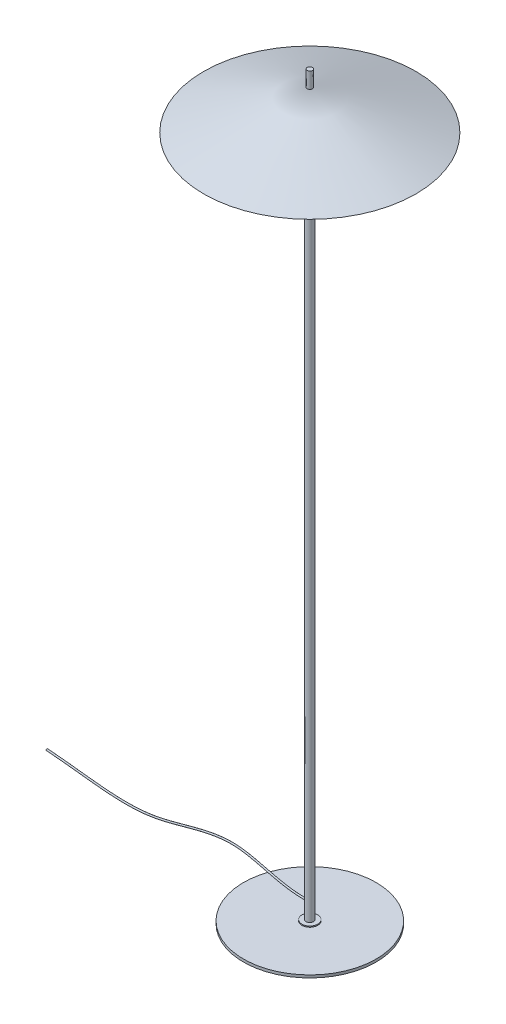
ISO-10303-21;
HEADER;
FILE_DESCRIPTION(('STEP AP214'),'2;1');
FILE_NAME('part.step','',(''),(''),'','','');
FILE_SCHEMA(('AUTOMOTIVE_DESIGN { 1 0 10303 214 1 1 1 1 }'));
ENDSEC;
DATA;
#1=APPLICATION_CONTEXT('core data for automotive mechanical design processes');
#2=APPLICATION_PROTOCOL_DEFINITION('international standard','automotive_design',2000,#1);
#3=PRODUCT_CONTEXT('',#1,'mechanical');
#4=PRODUCT('Part','Part','',(#3));
#5=PRODUCT_RELATED_PRODUCT_CATEGORY('part','',(#4));
#6=PRODUCT_DEFINITION_FORMATION('','',#4);
#7=PRODUCT_DEFINITION_CONTEXT('part definition',#1,'design');
#8=PRODUCT_DEFINITION('design','',#6,#7);
#9=PRODUCT_DEFINITION_SHAPE('','',#8);
#10=(LENGTH_UNIT() NAMED_UNIT(*) SI_UNIT(.MILLI.,.METRE.));
#11=(NAMED_UNIT(*) PLANE_ANGLE_UNIT() SI_UNIT($,.RADIAN.));
#12=(NAMED_UNIT(*) SI_UNIT($,.STERADIAN.) SOLID_ANGLE_UNIT());
#13=UNCERTAINTY_MEASURE_WITH_UNIT(LENGTH_MEASURE(1.E-05),#10,'distance_accuracy_value','');
#14=(GEOMETRIC_REPRESENTATION_CONTEXT(3) GLOBAL_UNCERTAINTY_ASSIGNED_CONTEXT((#13)) GLOBAL_UNIT_ASSIGNED_CONTEXT((#10,
#11,#12)) REPRESENTATION_CONTEXT('',''));
#15=CARTESIAN_POINT('',(0.,0.,0.));
#16=DIRECTION('',(0.,0.,1.));
#17=DIRECTION('',(1.,0.,0.));
#18=AXIS2_PLACEMENT_3D('',#15,#16,#17);
#19=CARTESIAN_POINT('',(0.,-1284.02242406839,0.));
#20=DIRECTION('',(0.,1.,0.));
#21=DIRECTION('',(0.,0.,1.));
#22=AXIS2_PLACEMENT_3D('',#19,#20,#21);
#23=PLANE('',#22);
#24=CARTESIAN_POINT('',(0.,-1284.02242406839,0.));
#25=DIRECTION('',(0.,1.,0.));
#26=DIRECTION('',(0.,0.,1.));
#27=AXIS2_PLACEMENT_3D('',#24,#25,#26);
#28=CIRCLE('',#27,15.);
#29=CARTESIAN_POINT('',(0.,-1284.02242406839,15.));
#30=VERTEX_POINT('',#29);
#31=EDGE_CURVE('E12',#30,#30,#28,.T.);
#32=ORIENTED_EDGE('',*,*,#31,.T.);
#33=EDGE_LOOP('',(#32));
#34=FACE_BOUND('',#33,.T.);
#35=CARTESIAN_POINT('',(0.,-1284.02242406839,0.));
#36=DIRECTION('',(0.,1.,0.));
#37=DIRECTION('',(0.,0.,1.));
#38=AXIS2_PLACEMENT_3D('',#35,#36,#37);
#39=CIRCLE('',#38,7.);
#40=CARTESIAN_POINT('',(0.,-1284.02242406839,7.));
#41=VERTEX_POINT('',#40);
#42=EDGE_CURVE('E76',#41,#41,#39,.T.);
#43=ORIENTED_EDGE('',*,*,#42,.F.);
#44=EDGE_LOOP('',(#43));
#45=FACE_BOUND('',#44,.T.);
#46=ADVANCED_FACE('F65',(#34,#45),#23,.T.);
#47=CARTESIAN_POINT('',(0.,-1286.02242406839,0.));
#48=DIRECTION('',(0.,1.,0.));
#49=DIRECTION('',(0.,0.,1.));
#50=AXIS2_PLACEMENT_3D('',#47,#48,#49);
#51=PLANE('',#50);
#52=CARTESIAN_POINT('',(0.,-1286.02242406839,0.));
#53=DIRECTION('',(0.,1.,0.));
#54=DIRECTION('',(0.,0.,1.));
#55=AXIS2_PLACEMENT_3D('',#52,#53,#54);
#56=CIRCLE('',#55,15.);
#57=CARTESIAN_POINT('',(0.,-1286.02242406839,15.));
#58=VERTEX_POINT('',#57);
#59=EDGE_CURVE('E69',#58,#58,#56,.T.);
#60=ORIENTED_EDGE('',*,*,#59,.F.);
#61=EDGE_LOOP('',(#60));
#62=FACE_BOUND('',#61,.T.);
#63=CARTESIAN_POINT('',(0.,-1286.02242406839,0.));
#64=DIRECTION('',(0.,1.,0.));
#65=DIRECTION('',(0.,0.,1.));
#66=AXIS2_PLACEMENT_3D('',#63,#64,#65);
#67=CIRCLE('',#66,7.);
#68=CARTESIAN_POINT('',(0.,-1286.02242406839,7.));
#69=VERTEX_POINT('',#68);
#70=EDGE_CURVE('E78',#69,#69,#67,.T.);
#71=ORIENTED_EDGE('',*,*,#70,.T.);
#72=EDGE_LOOP('',(#71));
#73=FACE_BOUND('',#72,.T.);
#74=ADVANCED_FACE('F88',(#62,#73),#51,.F.);
#75=CARTESIAN_POINT('',(0.,-1284.02242406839,0.));
#76=DIRECTION('',(0.,-1.,0.));
#77=DIRECTION('',(0.,0.,-1.));
#78=AXIS2_PLACEMENT_3D('',#75,#76,#77);
#79=CYLINDRICAL_SURFACE('',#78,15.);
#80=ORIENTED_EDGE('',*,*,#31,.F.);
#81=EDGE_LOOP('',(#80));
#82=FACE_BOUND('',#81,.T.);
#83=ORIENTED_EDGE('',*,*,#59,.T.);
#84=EDGE_LOOP('',(#83));
#85=FACE_BOUND('',#84,.T.);
#86=ADVANCED_FACE('F67',(#82,#85),#79,.T.);
#87=CARTESIAN_POINT('',(0.,-1284.02242406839,0.));
#88=DIRECTION('',(0.,-1.,0.));
#89=DIRECTION('',(0.,0.,-1.));
#90=AXIS2_PLACEMENT_3D('',#87,#88,#89);
#91=CYLINDRICAL_SURFACE('',#90,7.);
#92=ORIENTED_EDGE('',*,*,#42,.T.);
#93=EDGE_LOOP('',(#92));
#94=FACE_BOUND('',#93,.T.);
#95=ORIENTED_EDGE('',*,*,#70,.F.);
#96=EDGE_LOOP('',(#95));
#97=FACE_BOUND('',#96,.T.);
#98=ADVANCED_FACE('F84',(#94,#97),#91,.F.);
#99=CLOSED_SHELL('',(#46,#74,#86,#98));
#100=MANIFOLD_SOLID_BREP('B2',#99);
#101=CARTESIAN_POINT('',(0.,-1291.02242406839,0.));
#102=DIRECTION('',(0.,1.,0.));
#103=DIRECTION('',(0.,0.,1.));
#104=AXIS2_PLACEMENT_3D('',#101,#102,#103);
#105=CYLINDRICAL_SURFACE('',#104,125.);
#106=CARTESIAN_POINT('',(0.,-1291.02242406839,0.));
#107=DIRECTION('',(0.,-1.,0.));
#108=DIRECTION('',(0.,0.,-1.));
#109=AXIS2_PLACEMENT_3D('',#106,#107,#108);
#110=CIRCLE('',#109,125.);
#111=CARTESIAN_POINT('',(0.,-1291.02242406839,-125.));
#112=VERTEX_POINT('',#111);
#113=EDGE_CURVE('E64',#112,#112,#110,.T.);
#114=ORIENTED_EDGE('',*,*,#113,.F.);
#115=EDGE_LOOP('',(#114));
#116=FACE_BOUND('',#115,.T.);
#117=CARTESIAN_POINT('',(0.,-1286.02242406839,0.));
#118=DIRECTION('',(0.,-1.,0.));
#119=DIRECTION('',(0.,0.,-1.));
#120=AXIS2_PLACEMENT_3D('',#117,#118,#119);
#121=CIRCLE('',#120,125.);
#122=CARTESIAN_POINT('',(0.,-1286.02242406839,-125.));
#123=VERTEX_POINT('',#122);
#124=EDGE_CURVE('E139',#123,#123,#121,.T.);
#125=ORIENTED_EDGE('',*,*,#124,.T.);
#126=EDGE_LOOP('',(#125));
#127=FACE_BOUND('',#126,.T.);
#128=ADVANCED_FACE('F136',(#116,#127),#105,.T.);
#129=CARTESIAN_POINT('',(0.,-1291.02242406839,0.));
#130=DIRECTION('',(0.,-1.,0.));
#131=DIRECTION('',(0.,0.,-1.));
#132=AXIS2_PLACEMENT_3D('',#129,#130,#131);
#133=PLANE('',#132);
#134=ORIENTED_EDGE('',*,*,#113,.T.);
#135=EDGE_LOOP('',(#134));
#136=FACE_BOUND('',#135,.T.);
#137=ADVANCED_FACE('F151',(#136),#133,.T.);
#138=CARTESIAN_POINT('',(0.,-1286.02242406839,0.));
#139=DIRECTION('',(0.,-1.,0.));
#140=DIRECTION('',(0.,0.,-1.));
#141=AXIS2_PLACEMENT_3D('',#138,#139,#140);
#142=PLANE('',#141);
#143=ORIENTED_EDGE('',*,*,#124,.F.);
#144=EDGE_LOOP('',(#143));
#145=FACE_BOUND('',#144,.T.);
#146=ADVANCED_FACE('F149',(#145),#142,.F.);
#147=CLOSED_SHELL('',(#128,#137,#146));
#148=MANIFOLD_SOLID_BREP('B7',#147);
#149=CARTESIAN_POINT('',(0.,-66.0224240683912,0.));
#150=DIRECTION('',(0.,-1.,0.));
#151=DIRECTION('',(0.,0.,-1.));
#152=AXIS2_PLACEMENT_3D('',#149,#150,#151);
#153=PLANE('',#152);
#154=CARTESIAN_POINT('',(0.,-66.0224240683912,0.));
#155=DIRECTION('',(0.,-1.,0.));
#156=DIRECTION('',(0.,0.,-1.));
#157=AXIS2_PLACEMENT_3D('',#154,#155,#156);
#158=CIRCLE('',#157,7.);
#159=CARTESIAN_POINT('',(0.,-66.0224240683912,-7.));
#160=VERTEX_POINT('',#159);
#161=EDGE_CURVE('E201',#160,#160,#158,.T.);
#162=ORIENTED_EDGE('',*,*,#161,.F.);
#163=EDGE_LOOP('',(#162));
#164=FACE_BOUND('',#163,.T.);
#165=ADVANCED_FACE('F184',(#164),#153,.F.);
#166=CARTESIAN_POINT('',(0.,-1286.02242406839,0.));
#167=DIRECTION('',(0.,-1.,0.));
#168=DIRECTION('',(0.,0.,-1.));
#169=AXIS2_PLACEMENT_3D('',#166,#167,#168);
#170=PLANE('',#169);
#171=CARTESIAN_POINT('',(0.,-1286.02242406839,0.));
#172=DIRECTION('',(0.,-1.,0.));
#173=DIRECTION('',(0.,0.,-1.));
#174=AXIS2_PLACEMENT_3D('',#171,#172,#173);
#175=CIRCLE('',#174,7.);
#176=CARTESIAN_POINT('',(0.,-1286.02242406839,-7.));
#177=VERTEX_POINT('',#176);
#178=EDGE_CURVE('E196',#177,#177,#175,.T.);
#179=ORIENTED_EDGE('',*,*,#178,.T.);
#180=EDGE_LOOP('',(#179));
#181=FACE_BOUND('',#180,.T.);
#182=ADVANCED_FACE('F218',(#181),#170,.T.);
#183=CARTESIAN_POINT('',(0.,-66.0224240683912,0.));
#184=DIRECTION('',(0.,-1.,0.));
#185=DIRECTION('',(0.,0.,-1.));
#186=AXIS2_PLACEMENT_3D('',#183,#184,#185);
#187=CYLINDRICAL_SURFACE('',#186,7.);
#188=CARTESIAN_POINT('',(-7.00000000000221,-1256.18144920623,0.));
#189=CARTESIAN_POINT('',(-6.99999856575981,-1256.18144670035,0.0829595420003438));
#190=CARTESIAN_POINT('',(-6.99851019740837,-1256.17450686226,0.165952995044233));
#191=CARTESIAN_POINT('',(-6.99271734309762,-1256.14696791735,0.329578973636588));
#192=CARTESIAN_POINT('',(-6.98841078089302,-1256.12635873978,0.410209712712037));
#193=CARTESIAN_POINT('',(-6.97746266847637,-1256.07218014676,0.566713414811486));
#194=CARTESIAN_POINT('',(-6.970823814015,-1256.03862568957,0.642591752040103));
#195=CARTESIAN_POINT('',(-6.95592671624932,-1255.95957729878,0.787659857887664));
#196=CARTESIAN_POINT('',(-6.94766850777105,-1255.91408362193,0.856849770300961));
#197=CARTESIAN_POINT('',(-6.93026581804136,-1255.811588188,0.987856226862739));
#198=CARTESIAN_POINT('',(-6.92110895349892,-1255.75440880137,1.04953214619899));
#199=CARTESIAN_POINT('',(-6.90302540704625,-1255.63057586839,1.16255039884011));
#200=CARTESIAN_POINT('',(-6.89409875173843,-1255.56392123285,1.21389154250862));
#201=CARTESIAN_POINT('',(-6.87733598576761,-1255.42181482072,1.3055500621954));
#202=CARTESIAN_POINT('',(-6.86951866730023,-1255.34624396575,1.34568659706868));
#203=CARTESIAN_POINT('',(-6.85605895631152,-1255.18924226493,1.41266778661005));
#204=CARTESIAN_POINT('',(-6.85041634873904,-1255.10781199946,1.43951375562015));
#205=CARTESIAN_POINT('',(-6.84204988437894,-1254.94255385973,1.47876800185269));
#206=CARTESIAN_POINT('',(-6.83928778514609,-1254.85877297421,1.49136563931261));
#207=CARTESIAN_POINT('',(-6.83689164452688,-1254.69024527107,1.50231374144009));
#208=CARTESIAN_POINT('',(-6.83725715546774,-1254.60549859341,1.50066624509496));
#209=CARTESIAN_POINT('',(-6.84103793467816,-1254.43932963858,1.48333168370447));
#210=CARTESIAN_POINT('',(-6.844389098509,-1254.35787491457,1.46793970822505));
#211=CARTESIAN_POINT('',(-6.85366805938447,-1254.19875713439,1.42398527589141));
#212=CARTESIAN_POINT('',(-6.8595959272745,-1254.12109418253,1.3954224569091));
#213=CARTESIAN_POINT('',(-6.87337645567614,-1253.9714767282,1.32587677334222));
#214=CARTESIAN_POINT('',(-6.88123434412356,-1253.89953844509,1.28486010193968));
#215=CARTESIAN_POINT('',(-6.89799608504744,-1253.76349189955,1.19159074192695));
#216=CARTESIAN_POINT('',(-6.90690006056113,-1253.69938455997,1.13933673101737));
#217=CARTESIAN_POINT('',(-6.92496292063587,-1253.57951184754,1.02389404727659));
#218=CARTESIAN_POINT('',(-6.93412341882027,-1253.52393005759,0.960514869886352));
#219=CARTESIAN_POINT('',(-6.95151743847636,-1253.42411678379,0.825256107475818));
#220=CARTESIAN_POINT('',(-6.95975093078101,-1253.37988565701,0.75337625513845));
#221=CARTESIAN_POINT('',(-6.9744179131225,-1253.30383071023,0.60269848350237));
#222=CARTESIAN_POINT('',(-6.98084229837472,-1253.2720693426,0.523868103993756));
#223=CARTESIAN_POINT('',(-6.99111277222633,-1253.22223020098,0.36183585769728));
#224=CARTESIAN_POINT('',(-6.99495914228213,-1253.2041509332,0.278634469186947));
#225=CARTESIAN_POINT('',(-6.99960296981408,-1253.1824065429,0.111535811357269));
#226=CARTESIAN_POINT('',(-7.00044455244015,-1253.17853278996,0.027666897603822));
#227=CARTESIAN_POINT('',(-6.99910857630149,-1253.18474183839,-0.139524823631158));
#228=CARTESIAN_POINT('',(-6.99693117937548,-1253.19482389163,-0.222847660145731));
#229=CARTESIAN_POINT('',(-6.98983118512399,-1253.22847505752,-0.385822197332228));
#230=CARTESIAN_POINT('',(-6.98493308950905,-1253.25192384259,-0.465499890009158));
#231=CARTESIAN_POINT('',(-6.97293830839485,-1253.311521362,-0.61977705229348));
#232=CARTESIAN_POINT('',(-6.96584145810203,-1253.34767104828,-0.694376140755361));
#233=CARTESIAN_POINT('',(-6.95011732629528,-1253.43213877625,-0.837319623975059));
#234=CARTESIAN_POINT('',(-6.94147346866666,-1253.48059126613,-0.905582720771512));
#235=CARTESIAN_POINT('',(-6.92365040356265,-1253.58813926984,-1.03306113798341));
#236=CARTESIAN_POINT('',(-6.91447114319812,-1253.64723583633,-1.09227556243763));
#237=CARTESIAN_POINT('',(-6.89646325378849,-1253.7753639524,-1.2007773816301));
#238=CARTESIAN_POINT('',(-6.88764090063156,-1253.84451702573,-1.24992248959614));
#239=CARTESIAN_POINT('',(-6.87149060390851,-1253.99027213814,-1.33586563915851));
#240=CARTESIAN_POINT('',(-6.86416256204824,-1254.06687368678,-1.37266449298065));
#241=CARTESIAN_POINT('',(-6.85191344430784,-1254.22473122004,-1.43255545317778));
#242=CARTESIAN_POINT('',(-6.8469733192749,-1254.30594439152,-1.45575636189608));
#243=CARTESIAN_POINT('',(-6.83999853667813,-1254.47123012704,-1.48818681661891));
#244=CARTESIAN_POINT('',(-6.8379634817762,-1254.55530229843,-1.49741827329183));
#245=CARTESIAN_POINT('',(-6.83704600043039,-1254.7222419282,-1.50160085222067));
#246=CARTESIAN_POINT('',(-6.83810541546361,-1254.8051025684,-1.49681540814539));
#247=CARTESIAN_POINT('',(-6.84311716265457,-1254.96881541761,-1.47373147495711));
#248=CARTESIAN_POINT('',(-6.84706954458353,-1255.04966759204,-1.45543275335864));
#249=CARTESIAN_POINT('',(-6.85742069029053,-1255.20730909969,-1.40585146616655));
#250=CARTESIAN_POINT('',(-6.86382365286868,-1255.2840912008,-1.37454660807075));
#251=CARTESIAN_POINT('',(-6.87470836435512,-1255.39447526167,-1.31861309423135));
#252=CARTESIAN_POINT('',(-6.87855105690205,-1255.43047984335,-1.29846663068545));
#253=CARTESIAN_POINT('',(-6.8865609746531,-1255.50072933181,-1.25529349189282));
#254=CARTESIAN_POINT('',(-6.89072850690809,-1255.53497252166,-1.23226407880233));
#255=CARTESIAN_POINT('',(-6.903731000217,-1255.63610630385,-1.15803969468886));
#256=CARTESIAN_POINT('',(-6.91290450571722,-1255.69983585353,-1.10250052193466));
#257=CARTESIAN_POINT('',(-6.93111194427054,-1255.81712221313,-0.981536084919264));
#258=CARTESIAN_POINT('',(-6.94014587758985,-1255.87067904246,-0.916110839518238));
#259=CARTESIAN_POINT('',(-6.95288868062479,-1255.94250899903,-0.811539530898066));
#260=CARTESIAN_POINT('',(-6.9570235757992,-1255.96514272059,-0.775377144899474));
#261=CARTESIAN_POINT('',(-6.96488503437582,-1256.00724823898,-0.701261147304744));
#262=CARTESIAN_POINT('',(-6.96861196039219,-1256.02672285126,-0.663309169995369));
#263=CARTESIAN_POINT('',(-6.97901498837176,-1256.08017344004,-0.547134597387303));
#264=CARTESIAN_POINT('',(-6.98492560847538,-1256.10924275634,-0.466496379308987));
#265=CARTESIAN_POINT('',(-6.99289703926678,-1256.14785715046,-0.321452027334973));
#266=CARTESIAN_POINT('',(-6.99554397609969,-1256.1604281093,-0.257854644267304));
#267=CARTESIAN_POINT('',(-6.99909597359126,-1256.17722491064,-0.12951169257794));
#268=CARTESIAN_POINT('',(-7.00000111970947,-1256.18145116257,-0.0647661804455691));
#269=CARTESIAN_POINT('',(-7.00000000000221,-1256.18144920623,0.));
#270=B_SPLINE_CURVE_WITH_KNOTS('',3,(#188,#189,#190,#191,#192,#193,#194,#195,#196,#197,#198,
#199,#200,#201,#202,#203,#204,#205,#206,#207,#208,#209,#210,#211,#212,#213,#214,#215,#216,#217,
#218,#219,#220,#221,#222,#223,#224,#225,#226,#227,#228,#229,#230,#231,#232,#233,#234,#235,#236,
#237,#238,#239,#240,#241,#242,#243,#244,#245,#246,#247,#248,#249,#250,#251,#252,#253,#254,#255,
#256,#257,#258,#259,#260,#261,#262,#263,#264,#265,#266,#267,#268,#269),.UNSPECIFIED.,.T.,.F.,(4,
2,2,2,2,2,2,2,2,2,2,2,2,2,2,2,2,2,2,2,2,2,2,2,2,2,2,2,2,2,2,2,2,2,2,2,2,2,2,2,4),(0.,
0.248638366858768,0.497460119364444,0.745995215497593,0.994524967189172,1.24715873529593,
1.49982156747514,1.75635333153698,2.01285972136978,2.26591554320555,2.51893514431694,
2.76664972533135,3.01437111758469,3.26277107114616,3.51120026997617,3.76439435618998,
4.01759640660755,4.2720508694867,4.52647754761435,4.77715225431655,5.02781352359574,
5.27625318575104,5.52471147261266,5.77601153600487,6.02733646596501,6.28199927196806,
6.53664532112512,6.78922500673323,7.04177014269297,7.2895995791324,7.53743327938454,
7.78569353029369,7.90988336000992,8.03419203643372,8.288029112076,8.54186570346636,
8.67031047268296,8.7986401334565,9.05494916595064,9.2490696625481,9.44318063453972),.UNSPECIFIED.);
#271=CARTESIAN_POINT('',(-7.00000000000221,-1256.18144920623,0.));
#272=VERTEX_POINT('',#271);
#273=EDGE_CURVE('E134',#272,#272,#270,.T.);
#274=ORIENTED_EDGE('',*,*,#273,.F.);
#275=EDGE_LOOP('',(#274));
#276=FACE_BOUND('',#275,.T.);
#277=ORIENTED_EDGE('',*,*,#178,.F.);
#278=EDGE_LOOP('',(#277));
#279=FACE_BOUND('',#278,.T.);
#280=ORIENTED_EDGE('',*,*,#161,.T.);
#281=EDGE_LOOP('',(#280));
#282=FACE_BOUND('',#281,.T.);
#283=ADVANCED_FACE('F216',(#276,#279,#282),#187,.T.);
#284=CARTESIAN_POINT('',(-495.481401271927,-1254.51800329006,0.));
#285=DIRECTION('',(-0.997630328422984,0.068802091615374,0.));
#286=DIRECTION('',(-0.0688020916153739,-0.997630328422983,0.));
#287=AXIS2_PLACEMENT_3D('',#284,#285,#286);
#288=PLANE('',#287);
#289=CARTESIAN_POINT('',(-495.481401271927,-1254.51800329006,0.));
#290=DIRECTION('',(-0.997630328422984,0.068802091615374,0.));
#291=DIRECTION('',(-0.0688020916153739,-0.997630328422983,0.));
#292=AXIS2_PLACEMENT_3D('',#289,#290,#291);
#293=CIRCLE('',#292,1.5);
#294=CARTESIAN_POINT('',(-495.584604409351,-1256.01444878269,0.));
#295=VERTEX_POINT('',#294);
#296=EDGE_CURVE('E210',#295,#295,#293,.T.);
#297=ORIENTED_EDGE('',*,*,#296,.T.);
#298=EDGE_LOOP('',(#297));
#299=FACE_BOUND('',#298,.T.);
#300=ADVANCED_FACE('F211',(#299),#288,.T.);
#301=CARTESIAN_POINT('',(-2.4572294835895,-1256.0161587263,0.));
#302=CARTESIAN_POINT('',(-28.9617866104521,-1257.33180030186,0.));
#303=CARTESIAN_POINT('',(-52.7011738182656,-1252.32474152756,0.));
#304=CARTESIAN_POINT('',(-97.9228687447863,-1241.29523358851,0.));
#305=CARTESIAN_POINT('',(-119.410825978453,-1235.2839906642,0.));
#306=CARTESIAN_POINT('',(-165.964214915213,-1233.4587515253,0.));
#307=CARTESIAN_POINT('',(-191.456806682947,-1238.82727670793,0.));
#308=CARTESIAN_POINT('',(-242.904252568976,-1252.23030735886,0.));
#309=CARTESIAN_POINT('',(-268.84989802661,-1260.25828715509,0.));
#310=CARTESIAN_POINT('',(-327.116092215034,-1269.97850498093,0.));
#311=CARTESIAN_POINT('',(-358.902748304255,-1269.1228235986,0.));
#312=CARTESIAN_POINT('',(-424.583466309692,-1263.41902210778,0.));
#313=CARTESIAN_POINT('',(-458.484848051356,-1258.57305265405,0.));
#314=CARTESIAN_POINT('',(-495.584604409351,-1256.01444878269,0.));
#315=CARTESIAN_POINT('',(-2.4572294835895,-1256.0161587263,3.));
#316=CARTESIAN_POINT('',(-28.9617866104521,-1257.33180030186,3.));
#317=CARTESIAN_POINT('',(-52.7011738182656,-1252.32474152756,3.));
#318=CARTESIAN_POINT('',(-97.9228687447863,-1241.29523358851,3.));
#319=CARTESIAN_POINT('',(-119.410825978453,-1235.2839906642,3.));
#320=CARTESIAN_POINT('',(-165.964214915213,-1233.4587515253,3.));
#321=CARTESIAN_POINT('',(-191.456806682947,-1238.82727670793,3.));
#322=CARTESIAN_POINT('',(-242.904252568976,-1252.23030735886,3.));
#323=CARTESIAN_POINT('',(-268.84989802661,-1260.25828715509,3.));
#324=CARTESIAN_POINT('',(-327.116092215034,-1269.97850498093,3.));
#325=CARTESIAN_POINT('',(-358.902748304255,-1269.1228235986,3.));
#326=CARTESIAN_POINT('',(-424.583466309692,-1263.41902210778,3.));
#327=CARTESIAN_POINT('',(-458.484848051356,-1258.57305265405,3.));
#328=CARTESIAN_POINT('',(-495.584604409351,-1256.01444878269,3.));
#329=CARTESIAN_POINT('',(-2.60596130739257,-1253.01984785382,3.));
#330=CARTESIAN_POINT('',(-28.6453825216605,-1254.31240087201,3.));
#331=CARTESIAN_POINT('',(-52.0542601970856,-1249.39458199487,3.));
#332=CARTESIAN_POINT('',(-97.1480664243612,-1238.39626593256,3.));
#333=CARTESIAN_POINT('',(-118.827345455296,-1232.30456249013,3.));
#334=CARTESIAN_POINT('',(-166.364118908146,-1230.44076736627,3.));
#335=CARTESIAN_POINT('',(-192.124373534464,-1235.90105648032,3.));
#336=CARTESIAN_POINT('',(-243.749310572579,-1249.35032693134,3.));
#337=CARTESIAN_POINT('',(-269.623201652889,-1257.34583395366,3.));
#338=CARTESIAN_POINT('',(-327.249415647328,-1266.95928751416,3.));
#339=CARTESIAN_POINT('',(-358.757990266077,-1266.12410370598,3.));
#340=CARTESIAN_POINT('',(-424.209129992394,-1260.44023908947,3.));
#341=CARTESIAN_POINT('',(-458.144375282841,-1255.58940763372,3.));
#342=CARTESIAN_POINT('',(-495.378198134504,-1253.02155779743,3.));
#343=CARTESIAN_POINT('',(-2.60596130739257,-1253.01984785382,0.));
#344=CARTESIAN_POINT('',(-28.6453825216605,-1254.31240087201,0.));
#345=CARTESIAN_POINT('',(-52.0542601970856,-1249.39458199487,0.));
#346=CARTESIAN_POINT('',(-97.1480664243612,-1238.39626593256,0.));
#347=CARTESIAN_POINT('',(-118.827345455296,-1232.30456249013,0.));
#348=CARTESIAN_POINT('',(-166.364118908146,-1230.44076736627,0.));
#349=CARTESIAN_POINT('',(-192.124373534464,-1235.90105648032,0.));
#350=CARTESIAN_POINT('',(-243.749310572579,-1249.35032693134,0.));
#351=CARTESIAN_POINT('',(-269.623201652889,-1257.34583395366,0.));
#352=CARTESIAN_POINT('',(-327.249415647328,-1266.95928751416,0.));
#353=CARTESIAN_POINT('',(-358.757990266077,-1266.12410370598,0.));
#354=CARTESIAN_POINT('',(-424.209129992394,-1260.44023908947,0.));
#355=CARTESIAN_POINT('',(-458.14437528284,-1255.58940763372,0.));
#356=CARTESIAN_POINT('',(-495.378198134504,-1253.02155779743,0.));
#357=CARTESIAN_POINT('',(-2.60596130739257,-1253.01984785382,-3.));
#358=CARTESIAN_POINT('',(-28.6453825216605,-1254.31240087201,-3.));
#359=CARTESIAN_POINT('',(-52.0542601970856,-1249.39458199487,-3.));
#360=CARTESIAN_POINT('',(-97.1480664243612,-1238.39626593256,-3.));
#361=CARTESIAN_POINT('',(-118.827345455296,-1232.30456249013,-3.));
#362=CARTESIAN_POINT('',(-166.364118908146,-1230.44076736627,-3.));
#363=CARTESIAN_POINT('',(-192.124373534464,-1235.90105648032,-3.));
#364=CARTESIAN_POINT('',(-243.749310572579,-1249.35032693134,-3.));
#365=CARTESIAN_POINT('',(-269.623201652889,-1257.34583395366,-3.));
#366=CARTESIAN_POINT('',(-327.249415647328,-1266.95928751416,-3.));
#367=CARTESIAN_POINT('',(-358.757990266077,-1266.12410370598,-3.));
#368=CARTESIAN_POINT('',(-424.209129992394,-1260.44023908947,-3.));
#369=CARTESIAN_POINT('',(-458.144375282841,-1255.58940763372,-3.));
#370=CARTESIAN_POINT('',(-495.378198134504,-1253.02155779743,-3.));
#371=CARTESIAN_POINT('',(-2.4572294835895,-1256.0161587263,-3.));
#372=CARTESIAN_POINT('',(-28.9617866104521,-1257.33180030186,-3.));
#373=CARTESIAN_POINT('',(-52.7011738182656,-1252.32474152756,-3.));
#374=CARTESIAN_POINT('',(-97.9228687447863,-1241.29523358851,-3.));
#375=CARTESIAN_POINT('',(-119.410825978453,-1235.2839906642,-3.));
#376=CARTESIAN_POINT('',(-165.964214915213,-1233.4587515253,-3.));
#377=CARTESIAN_POINT('',(-191.456806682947,-1238.82727670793,-3.));
#378=CARTESIAN_POINT('',(-242.904252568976,-1252.23030735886,-3.));
#379=CARTESIAN_POINT('',(-268.84989802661,-1260.25828715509,-3.));
#380=CARTESIAN_POINT('',(-327.116092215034,-1269.97850498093,-3.));
#381=CARTESIAN_POINT('',(-358.902748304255,-1269.1228235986,-3.));
#382=CARTESIAN_POINT('',(-424.583466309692,-1263.41902210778,-3.));
#383=CARTESIAN_POINT('',(-458.484848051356,-1258.57305265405,-3.));
#384=CARTESIAN_POINT('',(-495.584604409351,-1256.01444878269,-3.));
#385=CARTESIAN_POINT('',(-2.4572294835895,-1256.0161587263,0.));
#386=CARTESIAN_POINT('',(-28.9617866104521,-1257.33180030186,0.));
#387=CARTESIAN_POINT('',(-52.7011738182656,-1252.32474152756,0.));
#388=CARTESIAN_POINT('',(-97.9228687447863,-1241.29523358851,0.));
#389=CARTESIAN_POINT('',(-119.410825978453,-1235.2839906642,0.));
#390=CARTESIAN_POINT('',(-165.964214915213,-1233.4587515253,0.));
#391=CARTESIAN_POINT('',(-191.456806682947,-1238.82727670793,0.));
#392=CARTESIAN_POINT('',(-242.904252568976,-1252.23030735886,0.));
#393=CARTESIAN_POINT('',(-268.84989802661,-1260.25828715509,0.));
#394=CARTESIAN_POINT('',(-327.116092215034,-1269.97850498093,0.));
#395=CARTESIAN_POINT('',(-358.902748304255,-1269.1228235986,0.));
#396=CARTESIAN_POINT('',(-424.583466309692,-1263.41902210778,0.));
#397=CARTESIAN_POINT('',(-458.484848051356,-1258.57305265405,0.));
#398=CARTESIAN_POINT('',(-495.584604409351,-1256.01444878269,0.));
#399=(BOUNDED_SURFACE() B_SPLINE_SURFACE(3,3,((#301,#302,#303,#304,#305,#306,#307,#308,#309,
#310,#311,#312,#313,#314),(#315,#316,#317,#318,#319,#320,#321,#322,#323,#324,#325,#326,#327,
#328),(#329,#330,#331,#332,#333,#334,#335,#336,#337,#338,#339,#340,#341,#342),(#343,#344,#345,
#346,#347,#348,#349,#350,#351,#352,#353,#354,#355,#356),(#357,#358,#359,#360,#361,#362,#363,
#364,#365,#366,#367,#368,#369,#370),(#371,#372,#373,#374,#375,#376,#377,#378,#379,#380,#381,
#382,#383,#384),(#385,#386,#387,#388,#389,#390,#391,#392,#393,#394,#395,#396,#397,#398)),
.UNSPECIFIED.,.T.,.F.,.F.) B_SPLINE_SURFACE_WITH_KNOTS((4,3,4),(4,2,2,2,2,2,4),(0.,0.5,1.),(0.,
0.141188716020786,0.282377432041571,0.439167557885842,0.595957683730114,0.797978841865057,1.),
.UNSPECIFIED.) GEOMETRIC_REPRESENTATION_ITEM() RATIONAL_B_SPLINE_SURFACE(((1.,1.,1.,1.,1.,1.,1.,
1.,1.,1.,1.,1.,1.,1.),(0.333333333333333,0.333333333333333,0.333333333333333,0.333333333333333,
0.333333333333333,0.333333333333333,0.333333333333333,0.333333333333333,0.333333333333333,
0.333333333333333,0.333333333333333,0.333333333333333,0.333333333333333,0.333333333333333),
(0.333333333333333,0.333333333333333,0.333333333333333,0.333333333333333,0.333333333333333,
0.333333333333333,0.333333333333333,0.333333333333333,0.333333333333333,0.333333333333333,
0.333333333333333,0.333333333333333,0.333333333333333,0.333333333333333),(1.,1.,1.,1.,1.,1.,1.,
1.,1.,1.,1.,1.,1.,1.),(0.333333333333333,0.333333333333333,0.333333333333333,0.333333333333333,
0.333333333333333,0.333333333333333,0.333333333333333,0.333333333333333,0.333333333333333,
0.333333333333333,0.333333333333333,0.333333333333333,0.333333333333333,0.333333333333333),
(0.333333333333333,0.333333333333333,0.333333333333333,0.333333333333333,0.333333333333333,
0.333333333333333,0.333333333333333,0.333333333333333,0.333333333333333,0.333333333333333,
0.333333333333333,0.333333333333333,0.333333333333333,0.333333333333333),(1.,1.,1.,1.,1.,1.,1.,
1.,1.,1.,1.,1.,1.,1.))) REPRESENTATION_ITEM('') SURFACE());
#400=ORIENTED_EDGE('',*,*,#273,.T.);
#401=EDGE_LOOP('',(#400));
#402=FACE_BOUND('',#401,.T.);
#403=ORIENTED_EDGE('',*,*,#296,.F.);
#404=EDGE_LOOP('',(#403));
#405=FACE_BOUND('',#404,.T.);
#406=ADVANCED_FACE('F224',(#402,#405),#399,.T.);
#407=CLOSED_SHELL('',(#165,#182,#283,#300,#406));
#408=MANIFOLD_SOLID_BREP('B59',#407);
#409=CARTESIAN_POINT('',(0.,50.,0.));
#410=DIRECTION('',(0.,-1.,0.));
#411=DIRECTION('',(1.,0.,0.));
#412=AXIS2_PLACEMENT_3D('',#409,#410,#411);
#413=CYLINDRICAL_SURFACE('',#412,20.);
#414=CARTESIAN_POINT('',(0.,50.,0.));
#415=DIRECTION('',(0.,1.,0.));
#416=DIRECTION('',(-1.,0.,0.));
#417=AXIS2_PLACEMENT_3D('',#414,#415,#416);
#418=CIRCLE('',#417,20.);
#419=CARTESIAN_POINT('',(-20.,50.,0.));
#420=VERTEX_POINT('',#419);
#421=EDGE_CURVE('E183',#420,#420,#418,.T.);
#422=ORIENTED_EDGE('',*,*,#421,.F.);
#423=EDGE_LOOP('',(#422));
#424=FACE_BOUND('',#423,.T.);
#425=CARTESIAN_POINT('',(0.,-50.,0.));
#426=DIRECTION('',(0.,1.,0.));
#427=DIRECTION('',(-1.,0.,0.));
#428=AXIS2_PLACEMENT_3D('',#425,#426,#427);
#429=CIRCLE('',#428,20.);
#430=CARTESIAN_POINT('',(-20.,-50.,0.));
#431=VERTEX_POINT('',#430);
#432=EDGE_CURVE('E283',#431,#431,#429,.T.);
#433=ORIENTED_EDGE('',*,*,#432,.T.);
#434=EDGE_LOOP('',(#433));
#435=FACE_BOUND('',#434,.T.);
#436=ADVANCED_FACE('F280',(#424,#435),#413,.T.);
#437=CARTESIAN_POINT('',(0.,50.,0.));
#438=DIRECTION('',(0.,1.,0.));
#439=DIRECTION('',(-1.,0.,0.));
#440=AXIS2_PLACEMENT_3D('',#437,#438,#439);
#441=PLANE('',#440);
#442=ORIENTED_EDGE('',*,*,#421,.T.);
#443=EDGE_LOOP('',(#442));
#444=FACE_BOUND('',#443,.T.);
#445=ADVANCED_FACE('F295',(#444),#441,.T.);
#446=CARTESIAN_POINT('',(0.,-50.,0.));
#447=DIRECTION('',(0.,1.,0.));
#448=DIRECTION('',(-1.,0.,0.));
#449=AXIS2_PLACEMENT_3D('',#446,#447,#448);
#450=PLANE('',#449);
#451=ORIENTED_EDGE('',*,*,#432,.F.);
#452=EDGE_LOOP('',(#451));
#453=FACE_BOUND('',#452,.T.);
#454=ADVANCED_FACE('F293',(#453),#450,.F.);
#455=CLOSED_SHELL('',(#436,#445,#454));
#456=MANIFOLD_SOLID_BREP('B128',#455);
#457=CARTESIAN_POINT('',(0.,74.,0.));
#458=DIRECTION('',(0.,1.,0.));
#459=DIRECTION('',(0.,0.,1.));
#460=AXIS2_PLACEMENT_3D('',#457,#458,#459);
#461=PLANE('',#460);
#462=CARTESIAN_POINT('',(0.,74.,0.));
#463=DIRECTION('',(0.,1.,0.));
#464=DIRECTION('',(0.,0.,1.));
#465=AXIS2_PLACEMENT_3D('',#462,#463,#464);
#466=CIRCLE('',#465,5.);
#467=CARTESIAN_POINT('',(0.,74.,5.));
#468=VERTEX_POINT('',#467);
#469=EDGE_CURVE('E337',#468,#468,#466,.T.);
#470=ORIENTED_EDGE('',*,*,#469,.F.);
#471=EDGE_LOOP('',(#470));
#472=FACE_BOUND('',#471,.T.);
#473=ADVANCED_FACE('F330',(#472),#461,.F.);
#474=CARTESIAN_POINT('',(0.,104.,0.));
#475=DIRECTION('',(0.,1.,0.));
#476=DIRECTION('',(0.,0.,1.));
#477=AXIS2_PLACEMENT_3D('',#474,#475,#476);
#478=PLANE('',#477);
#479=CARTESIAN_POINT('',(0.,104.,0.));
#480=DIRECTION('',(0.,1.,0.));
#481=DIRECTION('',(0.,0.,1.));
#482=AXIS2_PLACEMENT_3D('',#479,#480,#481);
#483=CIRCLE('',#482,5.);
#484=CARTESIAN_POINT('',(0.,104.,5.));
#485=VERTEX_POINT('',#484);
#486=EDGE_CURVE('E278',#485,#485,#483,.T.);
#487=ORIENTED_EDGE('',*,*,#486,.T.);
#488=EDGE_LOOP('',(#487));
#489=FACE_BOUND('',#488,.T.);
#490=ADVANCED_FACE('F344',(#489),#478,.T.);
#491=CARTESIAN_POINT('',(0.,74.,0.));
#492=DIRECTION('',(0.,1.,0.));
#493=DIRECTION('',(0.,0.,1.));
#494=AXIS2_PLACEMENT_3D('',#491,#492,#493);
#495=CYLINDRICAL_SURFACE('',#494,5.);
#496=ORIENTED_EDGE('',*,*,#486,.F.);
#497=EDGE_LOOP('',(#496));
#498=FACE_BOUND('',#497,.T.);
#499=ORIENTED_EDGE('',*,*,#469,.T.);
#500=EDGE_LOOP('',(#499));
#501=FACE_BOUND('',#500,.T.);
#502=ADVANCED_FACE('F346',(#498,#501),#495,.T.);
#503=CLOSED_SHELL('',(#473,#490,#502));
#504=MANIFOLD_SOLID_BREP('B178',#503);
#505=CARTESIAN_POINT('',(0.,-45.461481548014,0.));
#506=DIRECTION('',(0.,1.,0.));
#507=DIRECTION('',(0.,0.,1.));
#508=AXIS2_PLACEMENT_3D('',#505,#506,#507);
#509=PLANE('',#508);
#510=CARTESIAN_POINT('',(0.,-45.461481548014,0.));
#511=DIRECTION('',(0.,1.,0.));
#512=DIRECTION('',(0.,0.,1.));
#513=AXIS2_PLACEMENT_3D('',#510,#511,#512);
#514=CIRCLE('',#513,73.9999999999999);
#515=CARTESIAN_POINT('',(0.,-45.461481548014,-73.9999999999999));
#516=VERTEX_POINT('',#515);
#517=EDGE_CURVE('E328',#516,#516,#514,.T.);
#518=ORIENTED_EDGE('',*,*,#517,.T.);
#519=EDGE_LOOP('',(#518));
#520=FACE_BOUND('',#519,.T.);
#521=CARTESIAN_POINT('',(0.,-45.461481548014,0.));
#522=DIRECTION('',(0.,1.,0.));
#523=DIRECTION('',(0.,0.,1.));
#524=AXIS2_PLACEMENT_3D('',#521,#522,#523);
#525=CIRCLE('',#524,59.6508900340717);
#526=CARTESIAN_POINT('',(0.,-45.461481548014,59.6508900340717));
#527=VERTEX_POINT('',#526);
#528=EDGE_CURVE('E419',#527,#527,#525,.F.);
#529=ORIENTED_EDGE('',*,*,#528,.T.);
#530=EDGE_LOOP('',(#529));
#531=FACE_BOUND('',#530,.T.);
#532=ADVANCED_FACE('F382',(#520,#531),#509,.T.);
#533=CARTESIAN_POINT('',(0.,-73.461481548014,0.));
#534=DIRECTION('',(0.,1.,0.));
#535=DIRECTION('',(0.,0.,1.));
#536=AXIS2_PLACEMENT_3D('',#533,#534,#535);
#537=CONICAL_SURFACE('',#536,0.,1.2134876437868);
#538=CARTESIAN_POINT('',(0.,-45.7333262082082,0.));
#539=DIRECTION('',(0.,-1.,0.));
#540=DIRECTION('',(0.,0.,-1.));
#541=AXIS2_PLACEMENT_3D('',#538,#539,#540);
#542=CIRCLE('',#541,74.2718446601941);
#543=CARTESIAN_POINT('',(0.,-45.7333262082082,-74.2718446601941));
#544=VERTEX_POINT('',#543);
#545=EDGE_CURVE('E390',#544,#544,#542,.T.);
#546=ORIENTED_EDGE('',*,*,#545,.T.);
#547=EDGE_LOOP('',(#546));
#548=FACE_BOUND('',#547,.T.);
#549=CARTESIAN_POINT('',(0.,-73.461481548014,0.));
#550=VERTEX_POINT('',#549);
#551=VERTEX_LOOP('',#550);
#552=FACE_BOUND('',#551,.T.);
#553=ADVANCED_FACE('F399',(#548,#552),#537,.T.);
#554=CARTESIAN_POINT('',(0.,-67.0569831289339,0.));
#555=DIRECTION('',(0.,1.,0.));
#556=DIRECTION('',(0.,0.,1.));
#557=AXIS2_PLACEMENT_3D('',#554,#555,#556);
#558=CONICAL_SURFACE('',#557,0.,1.2134876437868);
#559=CARTESIAN_POINT('',(0.,-46.0930664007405,0.));
#560=DIRECTION('',(0.,1.,0.));
#561=DIRECTION('',(0.,0.,1.));
#562=AXIS2_PLACEMENT_3D('',#559,#560,#561);
#563=CIRCLE('',#562,56.1533483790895);
#564=CARTESIAN_POINT('',(0.,-46.0930664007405,56.1533483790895));
#565=VERTEX_POINT('',#564);
#566=EDGE_CURVE('E421',#565,#565,#563,.T.);
#567=ORIENTED_EDGE('',*,*,#566,.T.);
#568=EDGE_LOOP('',(#567));
#569=FACE_BOUND('',#568,.T.);
#570=CARTESIAN_POINT('',(0.,-67.0569831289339,0.));
#571=VERTEX_POINT('',#570);
#572=VERTEX_LOOP('',#571);
#573=FACE_BOUND('',#572,.T.);
#574=ADVANCED_FACE('F396',(#569,#573),#558,.F.);
#575=CARTESIAN_POINT('',(0.,-55.461481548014,0.));
#576=DIRECTION('',(0.,1.,0.));
#577=DIRECTION('',(0.,0.,1.));
#578=AXIS2_PLACEMENT_3D('',#575,#576,#577);
#579=TOROIDAL_SURFACE('',#578,59.6508900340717,10.);
#580=ORIENTED_EDGE('',*,*,#566,.F.);
#581=EDGE_LOOP('',(#580));
#582=FACE_BOUND('',#581,.T.);
#583=ORIENTED_EDGE('',*,*,#528,.F.);
#584=EDGE_LOOP('',(#583));
#585=FACE_BOUND('',#584,.T.);
#586=ADVANCED_FACE('F398',(#582,#585),#579,.T.);
#587=CARTESIAN_POINT('',(0.,-45.7333262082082,0.));
#588=DIRECTION('',(0.,-1.,0.));
#589=DIRECTION('',(0.,0.,-1.));
#590=AXIS2_PLACEMENT_3D('',#587,#588,#589);
#591=CONICAL_SURFACE('',#590,74.2718446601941,0.785398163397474);
#592=CARTESIAN_POINT('',(0.,-45.461481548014,-73.9999999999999));
#593=CARTESIAN_POINT('',(0.,-45.4643132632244,-74.0028317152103));
#594=CARTESIAN_POINT('',(0.,-45.4671449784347,-74.0056634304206));
#595=CARTESIAN_POINT('',(0.,-45.4728084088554,-74.0113268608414));
#596=CARTESIAN_POINT('',(0.,-45.4756401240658,-74.0141585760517));
#597=CARTESIAN_POINT('',(0.,-45.4813035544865,-74.0198220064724));
#598=CARTESIAN_POINT('',(0.,-45.4841352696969,-74.0226537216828));
#599=CARTESIAN_POINT('',(0.,-45.4897987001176,-74.0283171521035));
#600=CARTESIAN_POINT('',(0.,-45.4926304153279,-74.0311488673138));
#601=CARTESIAN_POINT('',(0.,-45.4982938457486,-74.0368122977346));
#602=CARTESIAN_POINT('',(0.,-45.501125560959,-74.0396440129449));
#603=CARTESIAN_POINT('',(0.,-45.5067889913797,-74.0453074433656));
#604=CARTESIAN_POINT('',(0.,-45.5096207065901,-74.048139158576));
#605=CARTESIAN_POINT('',(0.,-45.5152841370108,-74.0538025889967));
#606=CARTESIAN_POINT('',(0.,-45.5181158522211,-74.0566343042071));
#607=CARTESIAN_POINT('',(0.,-45.5237792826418,-74.0622977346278));
#608=CARTESIAN_POINT('',(0.,-45.5266109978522,-74.0651294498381));
#609=CARTESIAN_POINT('',(0.,-45.5322744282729,-74.0707928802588));
#610=CARTESIAN_POINT('',(0.,-45.5351061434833,-74.0736245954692));
#611=CARTESIAN_POINT('',(0.,-45.540769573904,-74.0792880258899));
#612=CARTESIAN_POINT('',(0.,-45.5436012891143,-74.0821197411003));
#613=CARTESIAN_POINT('',(0.,-45.549264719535,-74.087783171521));
#614=CARTESIAN_POINT('',(0.,-45.5520964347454,-74.0906148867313));
#615=CARTESIAN_POINT('',(0.,-45.5577598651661,-74.096278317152));
#616=CARTESIAN_POINT('',(0.,-45.5605915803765,-74.0991100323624));
#617=CARTESIAN_POINT('',(0.,-45.5662550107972,-74.1047734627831));
#618=CARTESIAN_POINT('',(0.,-45.5690867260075,-74.1076051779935));
#619=CARTESIAN_POINT('',(0.,-45.5747501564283,-74.1132686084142));
#620=CARTESIAN_POINT('',(0.,-45.5775818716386,-74.1161003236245));
#621=CARTESIAN_POINT('',(0.,-45.5832453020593,-74.1217637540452));
#622=CARTESIAN_POINT('',(0.,-45.5860770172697,-74.1245954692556));
#623=CARTESIAN_POINT('',(0.,-45.5917404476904,-74.1302588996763));
#624=CARTESIAN_POINT('',(0.,-45.5945721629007,-74.1330906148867));
#625=CARTESIAN_POINT('',(0.,-45.6002355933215,-74.1387540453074));
#626=CARTESIAN_POINT('',(0.,-45.6030673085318,-74.1415857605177));
#627=CARTESIAN_POINT('',(0.,-45.6087307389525,-74.1472491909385));
#628=CARTESIAN_POINT('',(0.,-45.6115624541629,-74.1500809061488));
#629=CARTESIAN_POINT('',(0.,-45.6172258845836,-74.1557443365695));
#630=CARTESIAN_POINT('',(0.,-45.6200575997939,-74.1585760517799));
#631=CARTESIAN_POINT('',(0.,-45.6257210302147,-74.1642394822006));
#632=CARTESIAN_POINT('',(0.,-45.628552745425,-74.1670711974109));
#633=CARTESIAN_POINT('',(0.,-45.6342161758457,-74.1727346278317));
#634=CARTESIAN_POINT('',(0.,-45.6370478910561,-74.175566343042));
#635=CARTESIAN_POINT('',(0.,-45.6427113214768,-74.1812297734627));
#636=CARTESIAN_POINT('',(0.,-45.6455430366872,-74.1840614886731));
#637=CARTESIAN_POINT('',(0.,-45.6512064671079,-74.1897249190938));
#638=CARTESIAN_POINT('',(0.,-45.6540381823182,-74.1925566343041));
#639=CARTESIAN_POINT('',(0.,-45.6597016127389,-74.1982200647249));
#640=CARTESIAN_POINT('',(0.,-45.6625333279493,-74.2010517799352));
#641=CARTESIAN_POINT('',(0.,-45.66819675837,-74.2067152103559));
#642=CARTESIAN_POINT('',(0.,-45.6710284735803,-74.2095469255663));
#643=CARTESIAN_POINT('',(0.,-45.6766919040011,-74.215210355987));
#644=CARTESIAN_POINT('',(0.,-45.6795236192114,-74.2180420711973));
#645=CARTESIAN_POINT('',(0.,-45.6851870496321,-74.2237055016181));
#646=CARTESIAN_POINT('',(0.,-45.6880187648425,-74.2265372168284));
#647=CARTESIAN_POINT('',(0.,-45.6936821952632,-74.2322006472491));
#648=CARTESIAN_POINT('',(0.,-45.6965139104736,-74.2350323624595));
#649=CARTESIAN_POINT('',(0.,-45.7021773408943,-74.2406957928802));
#650=CARTESIAN_POINT('',(0.,-45.7050090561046,-74.2435275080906));
#651=CARTESIAN_POINT('',(0.,-45.7106724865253,-74.2491909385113));
#652=CARTESIAN_POINT('',(0.,-45.7135042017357,-74.2520226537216));
#653=CARTESIAN_POINT('',(0.,-45.7191676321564,-74.2576860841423));
#654=CARTESIAN_POINT('',(0.,-45.7219993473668,-74.2605177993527));
#655=CARTESIAN_POINT('',(0.,-45.7276627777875,-74.2661812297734));
#656=CARTESIAN_POINT('',(0.,-45.7304944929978,-74.2690129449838));
#657=CARTESIAN_POINT('',(0.,-45.7333262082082,-74.2718446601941));
#658=B_SPLINE_CURVE_WITH_KNOTS('',3,(#592,#593,#594,#595,#596,#597,#598,#599,#600,#601,#602,
#603,#604,#605,#606,#607,#608,#609,#610,#611,#612,#613,#614,#615,#616,#617,#618,#619,#620,#621,
#622,#623,#624,#625,#626,#627,#628,#629,#630,#631,#632,#633,#634,#635,#636,#637,#638,#639,#640,
#641,#642,#643,#644,#645,#646,#647,#648,#649,#650,#651,#652,#653,#654,#655,#656,#657),
.UNSPECIFIED.,.F.,.F.,(4,2,2,2,2,2,2,2,2,2,2,2,2,2,2,2,2,2,2,2,2,2,2,2,2,2,2,2,2,2,2,2,4),(0.,
0.0120139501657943,0.0240279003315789,0.0360418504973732,0.0480558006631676,0.0600697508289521,
0.0720837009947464,0.0840976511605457,0.0961116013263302,0.108125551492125,0.120139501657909,
0.132153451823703,0.144167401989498,0.156181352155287,0.168195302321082,0.180209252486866,
0.19222320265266,0.204237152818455,0.216251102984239,0.228265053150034,0.240279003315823,
0.252292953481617,0.264306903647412,0.276320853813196,0.288334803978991,0.300348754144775,
0.312362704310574,0.324376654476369,0.336390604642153,0.348404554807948,0.360418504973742,
0.372432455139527,0.384446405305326),.UNSPECIFIED.);
#659=EDGE_CURVE('BSEAM384',#516,#544,#658,.T.);
#660=ORIENTED_EDGE('',*,*,#517,.F.);
#661=ORIENTED_EDGE('',*,*,#545,.F.);
#662=ORIENTED_EDGE('',*,*,#659,.T.);
#663=ORIENTED_EDGE('',*,*,#659,.F.);
#664=EDGE_LOOP('',(#660,#662,#661,#663));
#665=FACE_BOUND('',#664,.T.);
#666=ADVANCED_FACE('F384',(#665),#591,.T.);
#667=CLOSED_SHELL('',(#532,#553,#574,#586,#666));
#668=MANIFOLD_SOLID_BREP('B272',#667);
#669=CARTESIAN_POINT('',(0.,50.,0.));
#670=DIRECTION('',(0.,-1.,0.));
#671=DIRECTION('',(1.,0.,0.));
#672=AXIS2_PLACEMENT_3D('',#669,#670,#671);
#673=PLANE('',#672);
#674=CARTESIAN_POINT('',(0.,50.,0.));
#675=DIRECTION('',(0.,-1.,0.));
#676=DIRECTION('',(1.,0.,0.));
#677=AXIS2_PLACEMENT_3D('',#674,#675,#676);
#678=CIRCLE('',#677,37.);
#679=CARTESIAN_POINT('',(37.,50.,0.));
#680=VERTEX_POINT('',#679);
#681=EDGE_CURVE('E488',#680,#680,#678,.T.);
#682=ORIENTED_EDGE('',*,*,#681,.T.);
#683=EDGE_LOOP('',(#682));
#684=FACE_BOUND('',#683,.T.);
#685=CARTESIAN_POINT('',(0.,50.,0.));
#686=DIRECTION('',(0.,-1.,0.));
#687=DIRECTION('',(1.,0.,0.));
#688=AXIS2_PLACEMENT_3D('',#685,#686,#687);
#689=CIRCLE('',#688,40.);
#690=CARTESIAN_POINT('',(40.,50.,0.));
#691=VERTEX_POINT('',#690);
#692=EDGE_CURVE('E474',#691,#691,#689,.T.);
#693=ORIENTED_EDGE('',*,*,#692,.F.);
#694=EDGE_LOOP('',(#693));
#695=FACE_BOUND('',#694,.T.);
#696=ADVANCED_FACE('F467',(#684,#695),#673,.F.);
#697=CARTESIAN_POINT('',(0.,-50.,0.));
#698=DIRECTION('',(0.,-1.,0.));
#699=DIRECTION('',(1.,0.,0.));
#700=AXIS2_PLACEMENT_3D('',#697,#698,#699);
#701=PLANE('',#700);
#702=CARTESIAN_POINT('',(0.,-50.,0.));
#703=DIRECTION('',(0.,-1.,0.));
#704=DIRECTION('',(1.,0.,0.));
#705=AXIS2_PLACEMENT_3D('',#702,#703,#704);
#706=CIRCLE('',#705,37.);
#707=CARTESIAN_POINT('',(37.,-50.,0.));
#708=VERTEX_POINT('',#707);
#709=EDGE_CURVE('E490',#708,#708,#706,.T.);
#710=ORIENTED_EDGE('',*,*,#709,.F.);
#711=EDGE_LOOP('',(#710));
#712=FACE_BOUND('',#711,.T.);
#713=CARTESIAN_POINT('',(0.,-50.,0.));
#714=DIRECTION('',(0.,-1.,0.));
#715=DIRECTION('',(1.,0.,0.));
#716=AXIS2_PLACEMENT_3D('',#713,#714,#715);
#717=CIRCLE('',#716,40.);
#718=CARTESIAN_POINT('',(40.,-50.,0.));
#719=VERTEX_POINT('',#718);
#720=EDGE_CURVE('E380',#719,#719,#717,.T.);
#721=ORIENTED_EDGE('',*,*,#720,.T.);
#722=EDGE_LOOP('',(#721));
#723=FACE_BOUND('',#722,.T.);
#724=ADVANCED_FACE('F481',(#712,#723),#701,.T.);
#725=CARTESIAN_POINT('',(0.,50.,0.));
#726=DIRECTION('',(0.,-1.,0.));
#727=DIRECTION('',(1.,0.,0.));
#728=AXIS2_PLACEMENT_3D('',#725,#726,#727);
#729=CYLINDRICAL_SURFACE('',#728,40.);
#730=ORIENTED_EDGE('',*,*,#720,.F.);
#731=EDGE_LOOP('',(#730));
#732=FACE_BOUND('',#731,.T.);
#733=ORIENTED_EDGE('',*,*,#692,.T.);
#734=EDGE_LOOP('',(#733));
#735=FACE_BOUND('',#734,.T.);
#736=ADVANCED_FACE('F483',(#732,#735),#729,.T.);
#737=CARTESIAN_POINT('',(0.,110.,0.));
#738=DIRECTION('',(0.,-1.,0.));
#739=DIRECTION('',(1.,0.,0.));
#740=AXIS2_PLACEMENT_3D('',#737,#738,#739);
#741=CYLINDRICAL_SURFACE('',#740,37.);
#742=ORIENTED_EDGE('',*,*,#709,.T.);
#743=EDGE_LOOP('',(#742));
#744=FACE_BOUND('',#743,.T.);
#745=ORIENTED_EDGE('',*,*,#681,.F.);
#746=EDGE_LOOP('',(#745));
#747=FACE_BOUND('',#746,.T.);
#748=ADVANCED_FACE('F486',(#744,#747),#741,.F.);
#749=CLOSED_SHELL('',(#696,#724,#736,#748));
#750=MANIFOLD_SOLID_BREP('B322',#749);
#751=CARTESIAN_POINT('',(0.,0.,0.));
#752=DIRECTION('',(0.,-1.,0.));
#753=DIRECTION('',(0.,0.,-1.));
#754=AXIS2_PLACEMENT_3D('',#751,#752,#753);
#755=CONICAL_SURFACE('',#754,200.,1.20764931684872);
#756=CARTESIAN_POINT('',(0.,76.,0.));
#757=VERTEX_POINT('',#756);
#758=VERTEX_LOOP('',#757);
#759=FACE_BOUND('',#758,.T.);
#760=CARTESIAN_POINT('',(0.,0.,0.));
#761=DIRECTION('',(0.,-1.,0.));
#762=DIRECTION('',(0.,0.,-1.));
#763=AXIS2_PLACEMENT_3D('',#760,#761,#762);
#764=CIRCLE('',#763,200.);
#765=CARTESIAN_POINT('',(0.,0.,-200.));
#766=VERTEX_POINT('',#765);
#767=EDGE_CURVE('E465',#766,#766,#764,.T.);
#768=ORIENTED_EDGE('',*,*,#767,.F.);
#769=EDGE_LOOP('',(#768));
#770=FACE_BOUND('',#769,.T.);
#771=ADVANCED_FACE('F530',(#759,#770),#755,.T.);
#772=CARTESIAN_POINT('',(0.,0.,0.));
#773=DIRECTION('',(0.,-1.,0.));
#774=DIRECTION('',(0.,0.,-1.));
#775=AXIS2_PLACEMENT_3D('',#772,#773,#774);
#776=PLANE('',#775);
#777=CARTESIAN_POINT('',(0.,0.,0.));
#778=DIRECTION('',(0.,-1.,0.));
#779=DIRECTION('',(0.,0.,-1.));
#780=AXIS2_PLACEMENT_3D('',#777,#778,#779);
#781=CIRCLE('',#780,194.369650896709);
#782=CARTESIAN_POINT('',(0.,0.,-194.369650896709));
#783=VERTEX_POINT('',#782);
#784=EDGE_CURVE('E537',#783,#783,#781,.T.);
#785=ORIENTED_EDGE('',*,*,#784,.F.);
#786=EDGE_LOOP('',(#785));
#787=FACE_BOUND('',#786,.T.);
#788=ORIENTED_EDGE('',*,*,#767,.T.);
#789=EDGE_LOOP('',(#788));
#790=FACE_BOUND('',#789,.T.);
#791=ADVANCED_FACE('F546',(#787,#790),#776,.T.);
#792=CARTESIAN_POINT('',(0.,-1.8695671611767,0.));
#793=DIRECTION('',(0.,-1.,0.));
#794=DIRECTION('',(0.,0.,-1.));
#795=AXIS2_PLACEMENT_3D('',#792,#793,#794);
#796=CONICAL_SURFACE('',#795,199.289564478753,1.20764931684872);
#797=CARTESIAN_POINT('',(0.,73.8604673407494,0.));
#798=VERTEX_POINT('',#797);
#799=VERTEX_LOOP('',#798);
#800=FACE_BOUND('',#799,.T.);
#801=ORIENTED_EDGE('',*,*,#784,.T.);
#802=EDGE_LOOP('',(#801));
#803=FACE_BOUND('',#802,.T.);
#804=ADVANCED_FACE('F543',(#800,#803),#796,.F.);
#805=CLOSED_SHELL('',(#771,#791,#804));
#806=MANIFOLD_SOLID_BREP('B374',#805);
#807=ADVANCED_BREP_SHAPE_REPRESENTATION('',(#18,#100,#148,#408,#456,#504,#668,#750,#806),#14);
#808=SHAPE_DEFINITION_REPRESENTATION(#9,#807);
ENDSEC;
END-ISO-10303-21;
